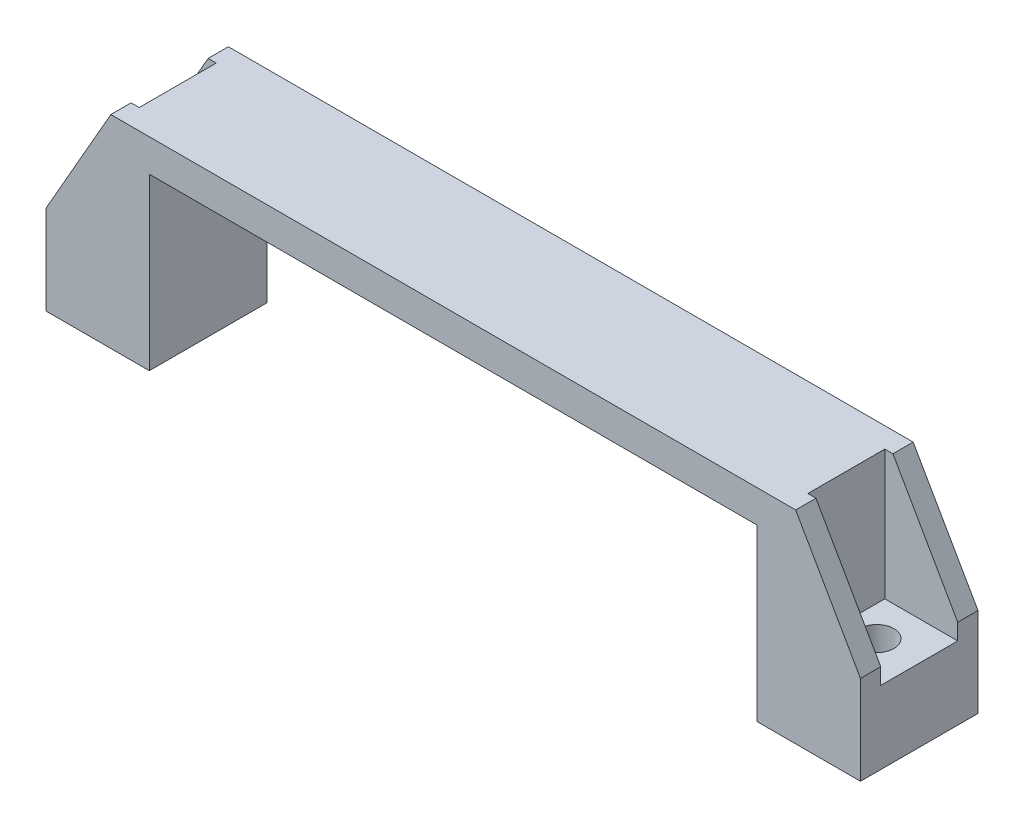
from build123d import *

# Parameters (mm, degrees)
SKETCH_2_W          = 201
SKETCH_2_H          = 50
EXTRUDE_1_DEPTH     = 14.5
SKETCH_3_W          = 150
SKETCH_3_H          = 42
CUT_EXTRUDE_1_DEPTH = 108.54650157
SKETCH_4_R          = 4.25
CUT_EXTRUDE_2_DEPTH = 114.18347936
SKETCH_5_W          = 18
SKETCH_5_H          = 19
CUT_EXTRUDE_3_DEPTH = 32


with BuildPart() as part:
    # Sketch 2 → Extrude 1 (new, symmetric)
    with BuildSketch(Plane.XY):
        Rectangle(SKETCH_2_W, SKETCH_2_H)
    extrude(amount=EXTRUDE_1_DEPTH, both=True)

    # Sketch 3 → Cut-Extrude 1 (cut, through all)
    with BuildSketch(Plane.XY.offset(14.5)):
        with Locations((0, -4)):
            Rectangle(SKETCH_3_W, SKETCH_3_H)
        Polygon((-84.5, 25), (-100.5, 25), (-100.5, -3), align=None)
        Polygon((100.5, -3), (84.5, 25), (100.5, 25), align=None)
    extrude(amount=-CUT_EXTRUDE_1_DEPTH, mode=Mode.SUBTRACT)

    # Sketch 4 → Cut-Extrude 2 (cut, through all)
    with BuildSketch(Plane.XZ.offset(25)):
        with Locations(Location((-90, 0, 0), (0, 0, 270))):
            Circle(SKETCH_4_R)
        with Locations(Location((90, 0, 0), (0, 0, 270))):
            Circle(SKETCH_4_R)
    extrude(amount=-CUT_EXTRUDE_2_DEPTH, mode=Mode.SUBTRACT)

    # Sketch 5 → Cut-Extrude 3 (cut)
    with BuildSketch(Plane(origin=(0, 25, 0), x_dir=(1, 0, 0), z_dir=(0, 1, 0))):
        with Locations((-91.5, 0)):
            Rectangle(SKETCH_5_W, SKETCH_5_H)
        with Locations((91.5, 0)):
            Rectangle(SKETCH_5_W, SKETCH_5_H)
    extrude(amount=-CUT_EXTRUDE_3_DEPTH, mode=Mode.SUBTRACT)


solid = part.part
